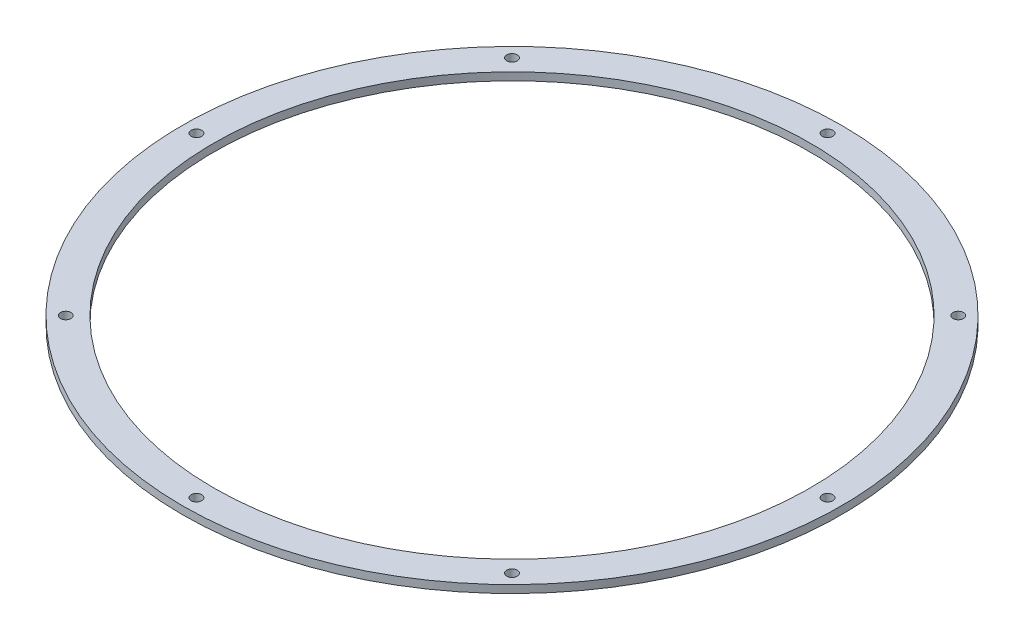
ISO-10303-21;
HEADER;
FILE_DESCRIPTION(('STEP AP214'),'2;1');
FILE_NAME('part.step','',(''),(''),'','','');
FILE_SCHEMA(('AUTOMOTIVE_DESIGN { 1 0 10303 214 1 1 1 1 }'));
ENDSEC;
DATA;
#1=APPLICATION_CONTEXT('core data for automotive mechanical design processes');
#2=APPLICATION_PROTOCOL_DEFINITION('international standard','automotive_design',2000,#1);
#3=PRODUCT_CONTEXT('',#1,'mechanical');
#4=PRODUCT('Part','Part','',(#3));
#5=PRODUCT_RELATED_PRODUCT_CATEGORY('part','',(#4));
#6=PRODUCT_DEFINITION_FORMATION('','',#4);
#7=PRODUCT_DEFINITION_CONTEXT('part definition',#1,'design');
#8=PRODUCT_DEFINITION('design','',#6,#7);
#9=PRODUCT_DEFINITION_SHAPE('','',#8);
#10=(LENGTH_UNIT() NAMED_UNIT(*) SI_UNIT(.MILLI.,.METRE.));
#11=(NAMED_UNIT(*) PLANE_ANGLE_UNIT() SI_UNIT($,.RADIAN.));
#12=(NAMED_UNIT(*) SI_UNIT($,.STERADIAN.) SOLID_ANGLE_UNIT());
#13=UNCERTAINTY_MEASURE_WITH_UNIT(LENGTH_MEASURE(1.E-05),#10,'distance_accuracy_value','');
#14=(GEOMETRIC_REPRESENTATION_CONTEXT(3) GLOBAL_UNCERTAINTY_ASSIGNED_CONTEXT((#13)) GLOBAL_UNIT_ASSIGNED_CONTEXT((#10,
#11,#12)) REPRESENTATION_CONTEXT('',''));
#15=CARTESIAN_POINT('',(0.,0.,0.));
#16=DIRECTION('',(0.,0.,1.));
#17=DIRECTION('',(1.,0.,0.));
#18=AXIS2_PLACEMENT_3D('',#15,#16,#17);
#19=CARTESIAN_POINT('',(0.,3.175,0.));
#20=DIRECTION('',(0.,1.,0.));
#21=DIRECTION('',(0.,0.,1.));
#22=AXIS2_PLACEMENT_3D('',#19,#20,#21);
#23=PLANE('',#22);
#24=CARTESIAN_POINT('',(91.1495996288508,3.175,-91.149599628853));
#25=DIRECTION('',(0.,1.,0.));
#26=DIRECTION('',(0.,0.,1.));
#27=AXIS2_PLACEMENT_3D('',#24,#25,#26);
#28=CIRCLE('',#27,2.15);
#29=CARTESIAN_POINT('',(91.1495996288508,3.175,-88.999599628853));
#30=VERTEX_POINT('',#29);
#31=EDGE_CURVE('E100',#30,#30,#28,.T.);
#32=ORIENTED_EDGE('',*,*,#31,.F.);
#33=EDGE_LOOP('',(#32));
#34=FACE_BOUND('',#33,.T.);
#35=CARTESIAN_POINT('',(128.905,3.175,-1.35020820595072E-12));
#36=DIRECTION('',(0.,1.,0.));
#37=DIRECTION('',(0.,0.,1.));
#38=AXIS2_PLACEMENT_3D('',#35,#36,#37);
#39=CIRCLE('',#38,2.15000000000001);
#40=CARTESIAN_POINT('',(128.905,3.175,2.14999999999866));
#41=VERTEX_POINT('',#40);
#42=EDGE_CURVE('E94',#41,#41,#39,.T.);
#43=ORIENTED_EDGE('',*,*,#42,.F.);
#44=EDGE_LOOP('',(#43));
#45=FACE_BOUND('',#44,.T.);
#46=CARTESIAN_POINT('',(91.1495996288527,3.175,91.1495996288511));
#47=DIRECTION('',(0.,1.,0.));
#48=DIRECTION('',(0.,0.,1.));
#49=AXIS2_PLACEMENT_3D('',#46,#47,#48);
#50=CIRCLE('',#49,2.15);
#51=CARTESIAN_POINT('',(91.1495996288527,3.175,93.2995996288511));
#52=VERTEX_POINT('',#51);
#53=EDGE_CURVE('E88',#52,#52,#50,.T.);
#54=ORIENTED_EDGE('',*,*,#53,.F.);
#55=EDGE_LOOP('',(#54));
#56=FACE_BOUND('',#55,.T.);
#57=CARTESIAN_POINT('',(0.,3.175,128.905));
#58=DIRECTION('',(0.,1.,0.));
#59=DIRECTION('',(0.,0.,1.));
#60=AXIS2_PLACEMENT_3D('',#57,#58,#59);
#61=CIRCLE('',#60,2.15);
#62=CARTESIAN_POINT('',(0.,3.175,131.055));
#63=VERTEX_POINT('',#62);
#64=EDGE_CURVE('E82',#63,#63,#61,.T.);
#65=ORIENTED_EDGE('',*,*,#64,.F.);
#66=EDGE_LOOP('',(#65));
#67=FACE_BOUND('',#66,.T.);
#68=CARTESIAN_POINT('',(-91.1495996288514,3.175,91.1495996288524));
#69=DIRECTION('',(0.,1.,0.));
#70=DIRECTION('',(0.,0.,1.));
#71=AXIS2_PLACEMENT_3D('',#68,#69,#70);
#72=CIRCLE('',#71,2.15);
#73=CARTESIAN_POINT('',(-91.1495996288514,3.175,93.2995996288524));
#74=VERTEX_POINT('',#73);
#75=EDGE_CURVE('E76',#74,#74,#72,.T.);
#76=ORIENTED_EDGE('',*,*,#75,.F.);
#77=EDGE_LOOP('',(#76));
#78=FACE_BOUND('',#77,.T.);
#79=CARTESIAN_POINT('',(-128.905,3.175,4.50069401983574E-13));
#80=DIRECTION('',(0.,1.,0.));
#81=DIRECTION('',(0.,0.,1.));
#82=AXIS2_PLACEMENT_3D('',#79,#80,#81);
#83=CIRCLE('',#82,2.15000000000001);
#84=CARTESIAN_POINT('',(-128.905,3.175,2.15000000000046));
#85=VERTEX_POINT('',#84);
#86=EDGE_CURVE('E70',#85,#85,#83,.T.);
#87=ORIENTED_EDGE('',*,*,#86,.F.);
#88=EDGE_LOOP('',(#87));
#89=FACE_BOUND('',#88,.T.);
#90=CARTESIAN_POINT('',(-91.1495996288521,3.175,-91.1495996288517));
#91=DIRECTION('',(0.,1.,0.));
#92=DIRECTION('',(0.,0.,1.));
#93=AXIS2_PLACEMENT_3D('',#90,#91,#92);
#94=CIRCLE('',#93,2.15);
#95=CARTESIAN_POINT('',(-91.1495996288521,3.175,-88.9995996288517));
#96=VERTEX_POINT('',#95);
#97=EDGE_CURVE('E64',#96,#96,#94,.T.);
#98=ORIENTED_EDGE('',*,*,#97,.F.);
#99=EDGE_LOOP('',(#98));
#100=FACE_BOUND('',#99,.T.);
#101=CARTESIAN_POINT('',(0.,3.175,-128.905));
#102=DIRECTION('',(0.,1.,0.));
#103=DIRECTION('',(0.,0.,1.));
#104=AXIS2_PLACEMENT_3D('',#101,#102,#103);
#105=CIRCLE('',#104,2.15);
#106=CARTESIAN_POINT('',(0.,3.175,-126.755));
#107=VERTEX_POINT('',#106);
#108=EDGE_CURVE('E58',#107,#107,#105,.T.);
#109=ORIENTED_EDGE('',*,*,#108,.F.);
#110=EDGE_LOOP('',(#109));
#111=FACE_BOUND('',#110,.T.);
#112=CARTESIAN_POINT('',(0.,3.175,0.));
#113=DIRECTION('',(0.,1.,0.));
#114=DIRECTION('',(0.,0.,1.));
#115=AXIS2_PLACEMENT_3D('',#112,#113,#114);
#116=CIRCLE('',#115,134.62);
#117=CARTESIAN_POINT('',(0.,3.175,134.62));
#118=VERTEX_POINT('',#117);
#119=EDGE_CURVE('E10',#118,#118,#116,.T.);
#120=ORIENTED_EDGE('',*,*,#119,.T.);
#121=EDGE_LOOP('',(#120));
#122=FACE_BOUND('',#121,.T.);
#123=CARTESIAN_POINT('',(0.,3.175,0.));
#124=DIRECTION('',(0.,1.,0.));
#125=DIRECTION('',(0.,0.,1.));
#126=AXIS2_PLACEMENT_3D('',#123,#124,#125);
#127=CIRCLE('',#126,121.92);
#128=CARTESIAN_POINT('',(0.,3.175,121.92));
#129=VERTEX_POINT('',#128);
#130=EDGE_CURVE('E48',#129,#129,#127,.T.);
#131=ORIENTED_EDGE('',*,*,#130,.F.);
#132=EDGE_LOOP('',(#131));
#133=FACE_BOUND('',#132,.T.);
#134=ADVANCED_FACE('F37',(#34,#45,#56,#67,#78,#89,#100,#111,#122,#133),#23,.T.);
#135=CARTESIAN_POINT('',(0.,0.,0.));
#136=DIRECTION('',(0.,1.,0.));
#137=DIRECTION('',(0.,0.,1.));
#138=AXIS2_PLACEMENT_3D('',#135,#136,#137);
#139=PLANE('',#138);
#140=CARTESIAN_POINT('',(91.1495996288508,0.,-91.149599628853));
#141=DIRECTION('',(0.,1.,0.));
#142=DIRECTION('',(0.,0.,1.));
#143=AXIS2_PLACEMENT_3D('',#140,#141,#142);
#144=CIRCLE('',#143,2.15);
#145=CARTESIAN_POINT('',(91.1495996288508,0.,-88.999599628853));
#146=VERTEX_POINT('',#145);
#147=EDGE_CURVE('E97',#146,#146,#144,.T.);
#148=ORIENTED_EDGE('',*,*,#147,.T.);
#149=EDGE_LOOP('',(#148));
#150=FACE_BOUND('',#149,.T.);
#151=CARTESIAN_POINT('',(128.905,0.,-1.35020820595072E-12));
#152=DIRECTION('',(0.,1.,0.));
#153=DIRECTION('',(0.,0.,1.));
#154=AXIS2_PLACEMENT_3D('',#151,#152,#153);
#155=CIRCLE('',#154,2.14999999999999);
#156=CARTESIAN_POINT('',(128.905,0.,2.14999999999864));
#157=VERTEX_POINT('',#156);
#158=EDGE_CURVE('E91',#157,#157,#155,.T.);
#159=ORIENTED_EDGE('',*,*,#158,.T.);
#160=EDGE_LOOP('',(#159));
#161=FACE_BOUND('',#160,.T.);
#162=CARTESIAN_POINT('',(91.1495996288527,0.,91.1495996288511));
#163=DIRECTION('',(0.,1.,0.));
#164=DIRECTION('',(0.,0.,1.));
#165=AXIS2_PLACEMENT_3D('',#162,#163,#164);
#166=CIRCLE('',#165,2.15);
#167=CARTESIAN_POINT('',(91.1495996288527,0.,93.2995996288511));
#168=VERTEX_POINT('',#167);
#169=EDGE_CURVE('E85',#168,#168,#166,.T.);
#170=ORIENTED_EDGE('',*,*,#169,.T.);
#171=EDGE_LOOP('',(#170));
#172=FACE_BOUND('',#171,.T.);
#173=CARTESIAN_POINT('',(0.,0.,128.905));
#174=DIRECTION('',(0.,1.,0.));
#175=DIRECTION('',(0.,0.,1.));
#176=AXIS2_PLACEMENT_3D('',#173,#174,#175);
#177=CIRCLE('',#176,2.15);
#178=CARTESIAN_POINT('',(0.,0.,131.055));
#179=VERTEX_POINT('',#178);
#180=EDGE_CURVE('E79',#179,#179,#177,.T.);
#181=ORIENTED_EDGE('',*,*,#180,.T.);
#182=EDGE_LOOP('',(#181));
#183=FACE_BOUND('',#182,.T.);
#184=CARTESIAN_POINT('',(-91.1495996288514,0.,91.1495996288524));
#185=DIRECTION('',(0.,1.,0.));
#186=DIRECTION('',(0.,0.,1.));
#187=AXIS2_PLACEMENT_3D('',#184,#185,#186);
#188=CIRCLE('',#187,2.15);
#189=CARTESIAN_POINT('',(-91.1495996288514,0.,93.2995996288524));
#190=VERTEX_POINT('',#189);
#191=EDGE_CURVE('E73',#190,#190,#188,.T.);
#192=ORIENTED_EDGE('',*,*,#191,.T.);
#193=EDGE_LOOP('',(#192));
#194=FACE_BOUND('',#193,.T.);
#195=CARTESIAN_POINT('',(-128.905,0.,4.50069401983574E-13));
#196=DIRECTION('',(0.,1.,0.));
#197=DIRECTION('',(0.,0.,1.));
#198=AXIS2_PLACEMENT_3D('',#195,#196,#197);
#199=CIRCLE('',#198,2.14999999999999);
#200=CARTESIAN_POINT('',(-128.905,0.,2.15000000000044));
#201=VERTEX_POINT('',#200);
#202=EDGE_CURVE('E67',#201,#201,#199,.T.);
#203=ORIENTED_EDGE('',*,*,#202,.T.);
#204=EDGE_LOOP('',(#203));
#205=FACE_BOUND('',#204,.T.);
#206=CARTESIAN_POINT('',(-91.1495996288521,0.,-91.1495996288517));
#207=DIRECTION('',(0.,1.,0.));
#208=DIRECTION('',(0.,0.,1.));
#209=AXIS2_PLACEMENT_3D('',#206,#207,#208);
#210=CIRCLE('',#209,2.15);
#211=CARTESIAN_POINT('',(-91.1495996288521,0.,-88.9995996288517));
#212=VERTEX_POINT('',#211);
#213=EDGE_CURVE('E61',#212,#212,#210,.T.);
#214=ORIENTED_EDGE('',*,*,#213,.T.);
#215=EDGE_LOOP('',(#214));
#216=FACE_BOUND('',#215,.T.);
#217=CARTESIAN_POINT('',(0.,0.,-128.905));
#218=DIRECTION('',(0.,1.,0.));
#219=DIRECTION('',(0.,0.,1.));
#220=AXIS2_PLACEMENT_3D('',#217,#218,#219);
#221=CIRCLE('',#220,2.15);
#222=CARTESIAN_POINT('',(0.,0.,-126.755));
#223=VERTEX_POINT('',#222);
#224=EDGE_CURVE('E53',#223,#223,#221,.T.);
#225=ORIENTED_EDGE('',*,*,#224,.T.);
#226=EDGE_LOOP('',(#225));
#227=FACE_BOUND('',#226,.T.);
#228=CARTESIAN_POINT('',(0.,0.,0.));
#229=DIRECTION('',(0.,1.,0.));
#230=DIRECTION('',(0.,0.,1.));
#231=AXIS2_PLACEMENT_3D('',#228,#229,#230);
#232=CIRCLE('',#231,134.62);
#233=CARTESIAN_POINT('',(0.,0.,134.62));
#234=VERTEX_POINT('',#233);
#235=EDGE_CURVE('E41',#234,#234,#232,.T.);
#236=ORIENTED_EDGE('',*,*,#235,.F.);
#237=EDGE_LOOP('',(#236));
#238=FACE_BOUND('',#237,.T.);
#239=CARTESIAN_POINT('',(0.,0.,0.));
#240=DIRECTION('',(0.,1.,0.));
#241=DIRECTION('',(0.,0.,1.));
#242=AXIS2_PLACEMENT_3D('',#239,#240,#241);
#243=CIRCLE('',#242,121.92);
#244=CARTESIAN_POINT('',(0.,0.,121.92));
#245=VERTEX_POINT('',#244);
#246=EDGE_CURVE('E50',#245,#245,#243,.T.);
#247=ORIENTED_EDGE('',*,*,#246,.T.);
#248=EDGE_LOOP('',(#247));
#249=FACE_BOUND('',#248,.T.);
#250=ADVANCED_FACE('F108',(#150,#161,#172,#183,#194,#205,#216,#227,#238,#249),#139,.F.);
#251=CARTESIAN_POINT('',(0.,3.175,0.));
#252=DIRECTION('',(0.,-1.,0.));
#253=DIRECTION('',(0.,0.,-1.));
#254=AXIS2_PLACEMENT_3D('',#251,#252,#253);
#255=CYLINDRICAL_SURFACE('',#254,134.62);
#256=ORIENTED_EDGE('',*,*,#119,.F.);
#257=EDGE_LOOP('',(#256));
#258=FACE_BOUND('',#257,.T.);
#259=ORIENTED_EDGE('',*,*,#235,.T.);
#260=EDGE_LOOP('',(#259));
#261=FACE_BOUND('',#260,.T.);
#262=ADVANCED_FACE('F39',(#258,#261),#255,.T.);
#263=CARTESIAN_POINT('',(0.,3.175,0.));
#264=DIRECTION('',(0.,-1.,0.));
#265=DIRECTION('',(0.,0.,-1.));
#266=AXIS2_PLACEMENT_3D('',#263,#264,#265);
#267=CYLINDRICAL_SURFACE('',#266,121.92);
#268=ORIENTED_EDGE('',*,*,#130,.T.);
#269=EDGE_LOOP('',(#268));
#270=FACE_BOUND('',#269,.T.);
#271=ORIENTED_EDGE('',*,*,#246,.F.);
#272=EDGE_LOOP('',(#271));
#273=FACE_BOUND('',#272,.T.);
#274=ADVANCED_FACE('F126',(#270,#273),#267,.F.);
#275=CARTESIAN_POINT('',(0.,3.175,-128.905));
#276=DIRECTION('',(0.,1.,0.));
#277=DIRECTION('',(0.,0.,1.));
#278=AXIS2_PLACEMENT_3D('',#275,#276,#277);
#279=CYLINDRICAL_SURFACE('',#278,2.15);
#280=ORIENTED_EDGE('',*,*,#224,.F.);
#281=EDGE_LOOP('',(#280));
#282=FACE_BOUND('',#281,.T.);
#283=ORIENTED_EDGE('',*,*,#108,.T.);
#284=EDGE_LOOP('',(#283));
#285=FACE_BOUND('',#284,.T.);
#286=ADVANCED_FACE('F129',(#282,#285),#279,.F.);
#287=CARTESIAN_POINT('',(-91.1495996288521,3.175,-91.1495996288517));
#288=DIRECTION('',(0.,1.,0.));
#289=DIRECTION('',(0.,0.,1.));
#290=AXIS2_PLACEMENT_3D('',#287,#288,#289);
#291=CYLINDRICAL_SURFACE('',#290,2.15);
#292=ORIENTED_EDGE('',*,*,#213,.F.);
#293=EDGE_LOOP('',(#292));
#294=FACE_BOUND('',#293,.T.);
#295=ORIENTED_EDGE('',*,*,#97,.T.);
#296=EDGE_LOOP('',(#295));
#297=FACE_BOUND('',#296,.T.);
#298=ADVANCED_FACE('F143',(#294,#297),#291,.F.);
#299=CARTESIAN_POINT('',(-128.905,3.175,4.50069401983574E-13));
#300=DIRECTION('',(0.,1.,0.));
#301=DIRECTION('',(0.,0.,1.));
#302=AXIS2_PLACEMENT_3D('',#299,#300,#301);
#303=CYLINDRICAL_SURFACE('',#302,2.15);
#304=ORIENTED_EDGE('',*,*,#202,.F.);
#305=EDGE_LOOP('',(#304));
#306=FACE_BOUND('',#305,.T.);
#307=ORIENTED_EDGE('',*,*,#86,.T.);
#308=EDGE_LOOP('',(#307));
#309=FACE_BOUND('',#308,.T.);
#310=ADVANCED_FACE('F147',(#306,#309),#303,.F.);
#311=CARTESIAN_POINT('',(-91.1495996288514,3.175,91.1495996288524));
#312=DIRECTION('',(0.,1.,0.));
#313=DIRECTION('',(0.,0.,1.));
#314=AXIS2_PLACEMENT_3D('',#311,#312,#313);
#315=CYLINDRICAL_SURFACE('',#314,2.15);
#316=ORIENTED_EDGE('',*,*,#191,.F.);
#317=EDGE_LOOP('',(#316));
#318=FACE_BOUND('',#317,.T.);
#319=ORIENTED_EDGE('',*,*,#75,.T.);
#320=EDGE_LOOP('',(#319));
#321=FACE_BOUND('',#320,.T.);
#322=ADVANCED_FACE('F151',(#318,#321),#315,.F.);
#323=CARTESIAN_POINT('',(0.,3.175,128.905));
#324=DIRECTION('',(0.,1.,0.));
#325=DIRECTION('',(0.,0.,1.));
#326=AXIS2_PLACEMENT_3D('',#323,#324,#325);
#327=CYLINDRICAL_SURFACE('',#326,2.15);
#328=ORIENTED_EDGE('',*,*,#180,.F.);
#329=EDGE_LOOP('',(#328));
#330=FACE_BOUND('',#329,.T.);
#331=ORIENTED_EDGE('',*,*,#64,.T.);
#332=EDGE_LOOP('',(#331));
#333=FACE_BOUND('',#332,.T.);
#334=ADVANCED_FACE('F155',(#330,#333),#327,.F.);
#335=CARTESIAN_POINT('',(91.1495996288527,3.175,91.1495996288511));
#336=DIRECTION('',(0.,1.,0.));
#337=DIRECTION('',(0.,0.,1.));
#338=AXIS2_PLACEMENT_3D('',#335,#336,#337);
#339=CYLINDRICAL_SURFACE('',#338,2.15);
#340=ORIENTED_EDGE('',*,*,#169,.F.);
#341=EDGE_LOOP('',(#340));
#342=FACE_BOUND('',#341,.T.);
#343=ORIENTED_EDGE('',*,*,#53,.T.);
#344=EDGE_LOOP('',(#343));
#345=FACE_BOUND('',#344,.T.);
#346=ADVANCED_FACE('F159',(#342,#345),#339,.F.);
#347=CARTESIAN_POINT('',(128.905,3.175,-1.35020820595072E-12));
#348=DIRECTION('',(0.,1.,0.));
#349=DIRECTION('',(0.,0.,1.));
#350=AXIS2_PLACEMENT_3D('',#347,#348,#349);
#351=CYLINDRICAL_SURFACE('',#350,2.15);
#352=ORIENTED_EDGE('',*,*,#158,.F.);
#353=EDGE_LOOP('',(#352));
#354=FACE_BOUND('',#353,.T.);
#355=ORIENTED_EDGE('',*,*,#42,.T.);
#356=EDGE_LOOP('',(#355));
#357=FACE_BOUND('',#356,.T.);
#358=ADVANCED_FACE('F163',(#354,#357),#351,.F.);
#359=CARTESIAN_POINT('',(91.1495996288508,3.175,-91.149599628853));
#360=DIRECTION('',(0.,1.,0.));
#361=DIRECTION('',(0.,0.,1.));
#362=AXIS2_PLACEMENT_3D('',#359,#360,#361);
#363=CYLINDRICAL_SURFACE('',#362,2.15);
#364=ORIENTED_EDGE('',*,*,#147,.F.);
#365=EDGE_LOOP('',(#364));
#366=FACE_BOUND('',#365,.T.);
#367=ORIENTED_EDGE('',*,*,#31,.T.);
#368=EDGE_LOOP('',(#367));
#369=FACE_BOUND('',#368,.T.);
#370=ADVANCED_FACE('F104',(#366,#369),#363,.F.);
#371=CLOSED_SHELL('',(#134,#250,#262,#274,#286,#298,#310,#322,#334,#346,#358,#370));
#372=MANIFOLD_SOLID_BREP('B2',#371);
#373=ADVANCED_BREP_SHAPE_REPRESENTATION('',(#18,#372),#14);
#374=SHAPE_DEFINITION_REPRESENTATION(#9,#373);
ENDSEC;
END-ISO-10303-21;
